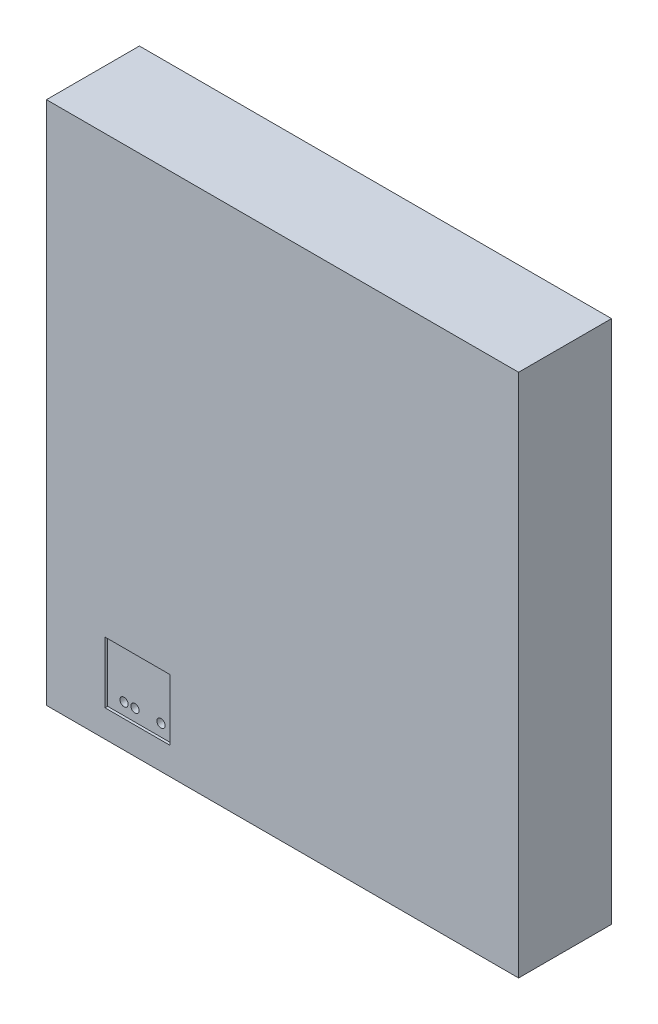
from build123d import *

# Parameters (mm, degrees)
SKETCH1_W          = 457.2
SKETCH1_H          = 508
EXTRUDE1_DEPTH     = 90
SKETCH2_W          = 62.893771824
SKETCH2_H          = 59.351746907
CUT_EXTRUDE1_DEPTH = 2.54
SKETCH2_3_R        = 4
CUT_EXTRUDE2_DEPTH = 20


with BuildPart() as part:
    # Sketch1 → Extrude1 (new body)
    with BuildSketch(Plane.XY):
        with Locations((228.6, 254)):
            Rectangle(SKETCH1_W, SKETCH1_H)
    extrude(amount=-EXTRUDE1_DEPTH)

    # Sketch2 → Cut-Extrude1 (cut)
    with BuildSketch(Plane.XY):
        with Locations((88.187832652, 56.009132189)):
            Rectangle(SKETCH2_W, SKETCH2_H)
    extrude(amount=-CUT_EXTRUDE1_DEPTH, mode=Mode.SUBTRACT)

    # Sketch2_3 → Cut-Extrude2 (cut)
    with BuildSketch(Plane.XY):
        with Locations((72.570849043, 37.902070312)):
            Circle(SKETCH2_3_R)
        with Locations((83.208259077, 37.902070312)):
            Circle(SKETCH2_3_R)
        with Locations((108.39035411, 37.902070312)):
            Circle(SKETCH2_3_R)
    extrude(amount=-CUT_EXTRUDE2_DEPTH, mode=Mode.SUBTRACT)


solid = part.part
